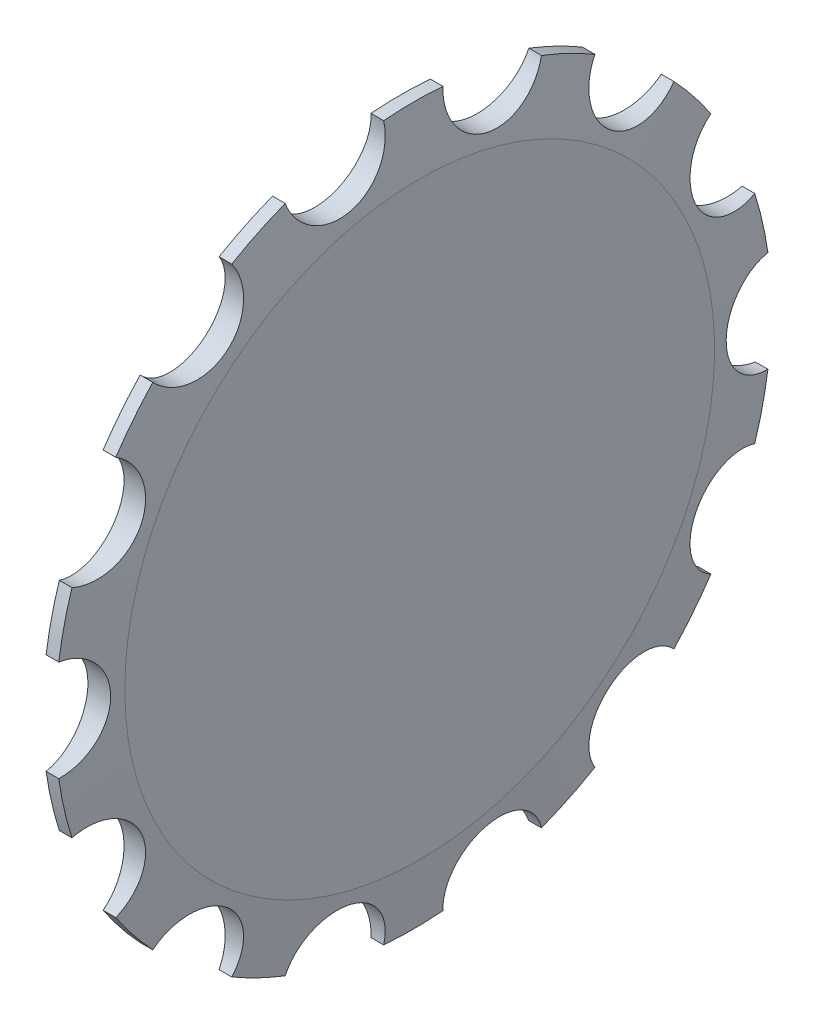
from build123d import *

# Parameters (mm, degrees)
ESQUISSE2_R             = 4
ENL_V_MAT_EXTRU_1_DEPTH = 42.728287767


with BuildPart() as part:
    # Esquisse1 → Base-R_volution (revolve)
    with BuildSketch(Plane.XY, mode=Mode.PRIVATE) as base_r_volution_sk:
        Polygon((-0.995848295, -2.3), (1.004151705, -2.3), (1.004151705, 21), (0.5, 26), (-0.5, 26), (-0.995848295, 21), align=None)
    revolve(base_r_volution_sk.sketch.rotate(Axis((-40, -2.3, 0), (1, 0, 0)), 278.1023776), axis=Axis((-40, -2.3, 0), (1, 0, 0)))

    # Esquisse2 → Enl_v. mat.-Extru.1 (cut, through all)
    with BuildSketch(Plane(origin=(1.004151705, 0, 0), x_dir=(0, 0, -1), z_dir=(1, 0, 0))):
        with Locations((-28.318388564, -2.3)):
            Circle(ESQUISSE2_R)
        with Locations((-25.513986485, -14.586888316)):
            Circle(ESQUISSE2_R)
        with Locations((-17.656226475, -24.440207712)):
            Circle(ESQUISSE2_R)
        with Locations((-6.301434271, -29.908387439)):
            Circle(ESQUISSE2_R)
        with Locations((6.301434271, -29.908387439)):
            Circle(ESQUISSE2_R)
        with Locations((17.656226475, -24.440207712)):
            Circle(ESQUISSE2_R)
        with Locations((25.513986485, -14.586888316)):
            Circle(ESQUISSE2_R)
        with Locations((28.318388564, -2.3)):
            Circle(ESQUISSE2_R)
        with Locations((25.513986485, 9.986888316)):
            Circle(ESQUISSE2_R)
        with Locations((17.656226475, 19.840207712)):
            Circle(ESQUISSE2_R)
        with Locations((6.301434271, 25.308387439)):
            Circle(ESQUISSE2_R)
        with Locations((-6.301434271, 25.308387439)):
            Circle(ESQUISSE2_R)
        with Locations((-17.656226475, 19.840207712)):
            Circle(ESQUISSE2_R)
        with Locations((-25.513986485, 9.986888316)):
            Circle(ESQUISSE2_R)
    extrude(amount=-ENL_V_MAT_EXTRU_1_DEPTH, mode=Mode.SUBTRACT)


solid = part.part
